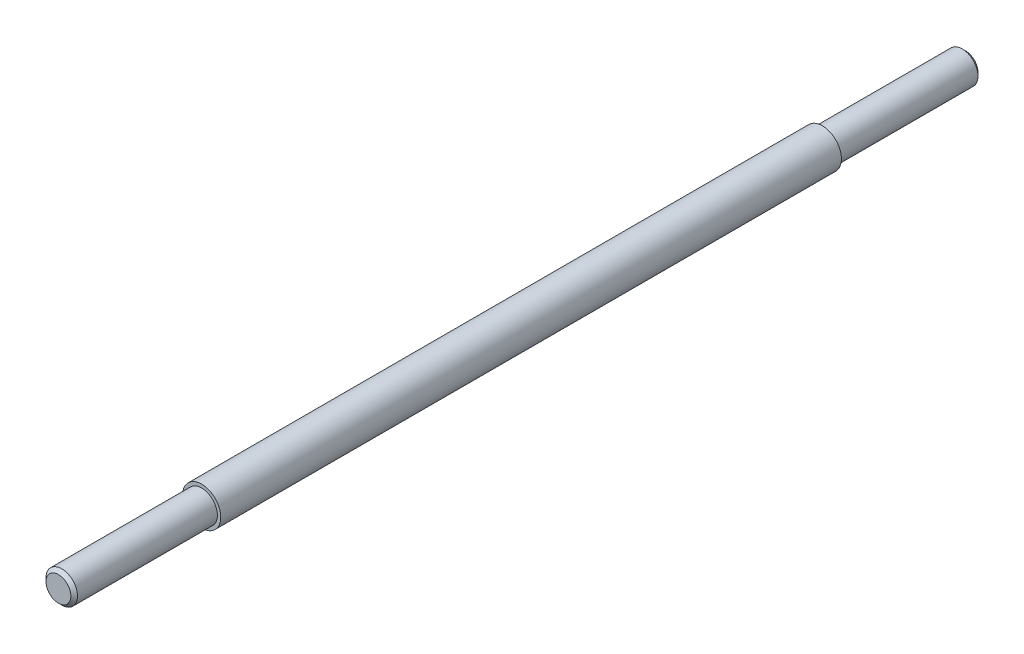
from build123d import *

# Parameters (mm, degrees)
SKETCH1_R      = 2
EXTRUDE1_DEPTH = 95
SKETCH2_R      = 4.577940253
SKETCH2_R_2    = 1.65
EXTRUDE2_DEPTH = 15
EXTRUDE3_START = -15
SKETCH3_R      = 4.772126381
SKETCH3_R_2    = 1.65
EXTRUDE3_DEPTH = 15
CHAMFER1_SIZE  = 0.35


with BuildPart() as part:
    # Sketch1 → Extrude1 (new body)
    with BuildSketch(Plane.XY):
        Circle(SKETCH1_R)
    extrude(amount=EXTRUDE1_DEPTH)

    # Sketch2 → Extrude2 (cut)
    with BuildSketch(Plane.XY.offset(95)):
        Circle(SKETCH2_R)
        Circle(SKETCH2_R_2, mode=Mode.SUBTRACT)
    extrude(amount=-EXTRUDE2_DEPTH, mode=Mode.SUBTRACT)

    # Sketch3 → Extrude3 (cut)
    with BuildSketch(Plane(origin=(0, 0, 0), x_dir=(-1, 0, 0), z_dir=(0, 0, -1)).offset(EXTRUDE3_START)):
        Circle(SKETCH3_R)
        with Locations(Location((0, 0, 0), (0, 0, 180))):
            Circle(SKETCH3_R_2, mode=Mode.SUBTRACT)
    extrude(amount=EXTRUDE3_DEPTH, mode=Mode.SUBTRACT)

    # Chamfer1
    chamfer1_edges = [part.edges().sort_by_distance(p)[0] for p in [
        (-1.65, 0, 0),
        (-1.65, 0, 95),
    ]]
    chamfer(chamfer1_edges, length=CHAMFER1_SIZE)


solid = part.part
